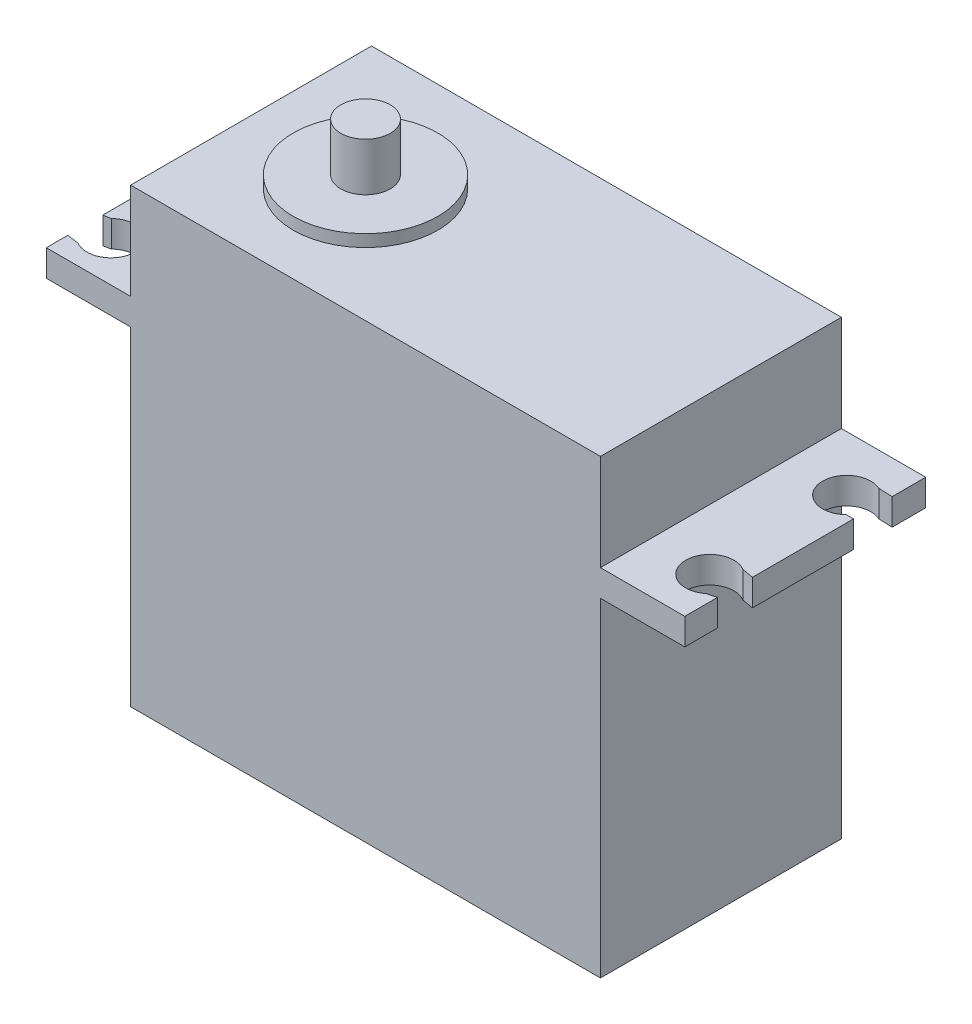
from build123d import *

# Parameters (mm, degrees)
SKETCH1_W                = 39
SKETCH1_H                = 20
BOSS_EXTRUDE1_DEPTH      = 37.5
BOSS_EXTRUDE2_DEPTH      = 7
BOSS_EXTRUDE2_DEPTH_BACK = 46
SKETCH2_W                = 20
SKETCH2_H                = 2.2
CUT_EXTRUDE3_DEPTH       = 7
SKETCH5_R                = 2.051313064
BOSS_EXTRUDE4_DEPTH      = 5
SKETCH4_R                = 6
BOSS_EXTRUDE5_DEPTH      = 1


with BuildPart() as part:
    # Sketch1 → Boss-Extrude1 (new body)
    with BuildSketch(Plane(origin=(0, 0, 0), x_dir=(1, 0, 0), z_dir=(0, 1, 0))):
        with Locations((4.319620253, 1.545886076)):
            Rectangle(SKETCH1_W, SKETCH1_H)
    extrude(amount=BOSS_EXTRUDE1_DEPTH)

    # Sketch2 → Boss-Extrude2 (add, two sides: drawn at the far end of the back side and taken through both)
    with BuildSketch(Plane(origin=(23.819620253, 0, 0), x_dir=(0, 0, -1), z_dir=(1, 0, 0)).offset(-BOSS_EXTRUDE2_DEPTH_BACK)):
        with Locations((1.545886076, 28.4)):
            Rectangle(SKETCH2_W, SKETCH2_H)
    extrude(amount=BOSS_EXTRUDE2_DEPTH + BOSS_EXTRUDE2_DEPTH_BACK)

    # Sketch3 → Cut-Extrude3 (cut)
    with BuildSketch(Plane(origin=(0, 29.5, 0), x_dir=(1, 0, 0), z_dir=(0, 1, 0))):
        with BuildLine():
            Line((30.219682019, 5.560743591), (32.229671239, 5.560743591))
            Line((32.229671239, 5.560743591), (32.229671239, 8.714246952))
            Line((32.229671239, 8.714246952), (29.667466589, 8.800365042))
            ThreePointArc((29.667466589, 8.800365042), (26.84805755, 6.652902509), (30.219682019, 5.560743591))
        make_face()
        with BuildLine():
            Line((32.858489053, -3.195881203), (29.854325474, -2.665891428))
            ThreePointArc((29.854325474, -2.665891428), (26.824509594, -4.517198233), (30.08284416, -5.92800545))
            Line((30.08284416, -5.92800545), (32.858489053, -5.208809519))
            Line((32.858489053, -5.208809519), (32.858489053, -3.195881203))
        make_face()
        with BuildLine():
            Line((-25.609138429, 8.308277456), (-25.609138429, 6.402818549))
            Line((-25.609138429, 6.402818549), (-21.580441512, 5.560743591))
            ThreePointArc((-21.580441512, 5.560743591), (-18.195380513, 6.74447325), (-21.192019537, 8.714246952))
            Line((-21.192019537, 8.714246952), (-25.609138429, 8.308277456))
        make_face()
        with BuildLine():
            Line((-21.580441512, -3.655597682), (-25.609138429, -4.377436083))
            Line((-25.609138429, -4.377436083), (-25.609138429, -6.17119986))
            Line((-25.609138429, -6.17119986), (-21.192019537, -6.809101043))
            ThreePointArc((-21.192019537, -6.809101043), (-18.195380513, -4.839327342), (-21.580441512, -3.655597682))
        make_face()
    extrude(amount=-CUT_EXTRUDE3_DEPTH, mode=Mode.SUBTRACT)

    # Sketch5 → Boss-Extrude4 (add)
    with BuildSketch(Plane(origin=(0, 37.5, 0), x_dir=(1, 0, 0), z_dir=(0, 1, 0))):
        with Locations(Location((-5.180379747, 1.045886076, 0), (0, 0, 270))):
            Circle(SKETCH5_R)
    extrude(amount=BOSS_EXTRUDE4_DEPTH)

    # Sketch4 → Boss-Extrude5 (add)
    with BuildSketch(Plane(origin=(0, 37.5, 0), x_dir=(1, 0, 0), z_dir=(0, 1, 0))):
        with Locations(Location((-5.180379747, 1.045886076, 0), (0, 0, 270))):
            Circle(SKETCH4_R)
    extrude(amount=BOSS_EXTRUDE5_DEPTH)


solid = part.part
